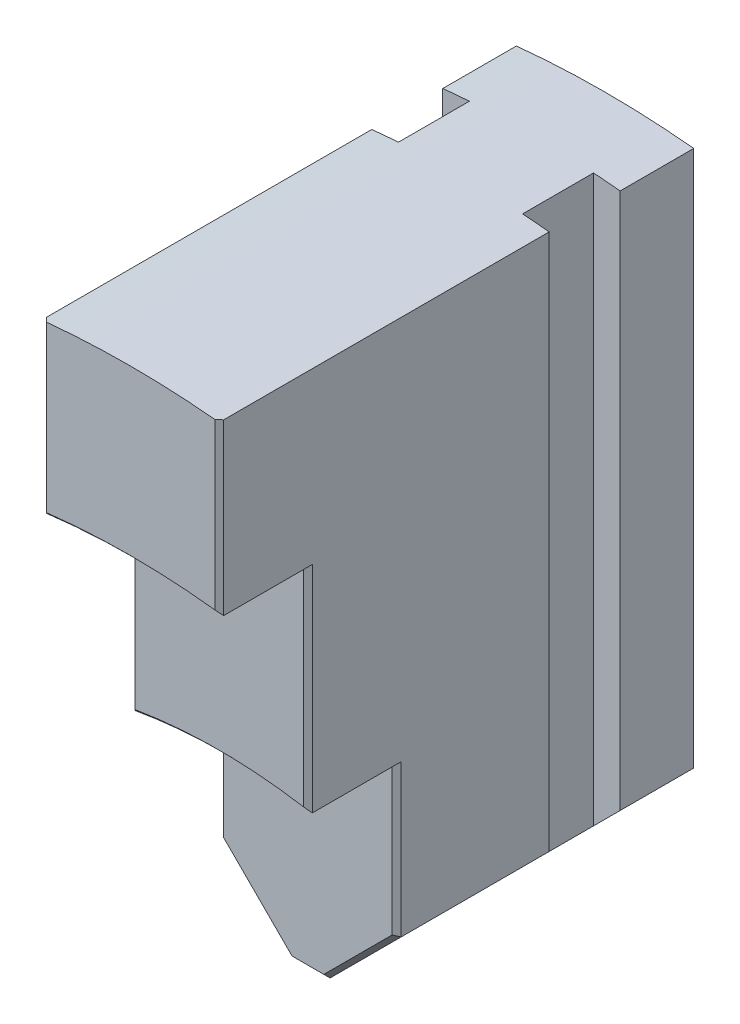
from build123d import *

# Parameters (mm, degrees)
BASE_EXTRUSION_DEPTH      = 32.5
BASE_EXTRUSION_DEPTH_BACK = 21
ESQUISSE2_W               = 10
ESQUISSE2_H               = 8
ENL_V_MAT_EXTRU_3_DEPTH   = 77.923663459
ESQUISSE9_R               = 81
ENL_V_MAT_EXTRU_9_DEPTH   = 10
ESQUISSE10_R              = 57
ENL_V_MAT_EXTRU_11_DEPTH  = 10
CHANFREIN3_SIZE           = 0.5


with BuildPart() as part:
    # Esquisse1 → Base-Extrusion (new, two sides: drawn at the far end of the back side and taken through both)
    with BuildSketch(Plane.XY.offset(-BASE_EXTRUSION_DEPTH_BACK)):
        with BuildLine():
            Line((2, 0), (10, 8))
            Line((10, 8), (10, 68.498743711))
            ThreePointArc((10, 68.498743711), (0, 69), (-10, 68.498743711))
            Line((-10, 68.498743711), (-10, 8))
            Line((-10, 8), (-2, 0))
            Line((-2, 0), (2, 0))
        make_face()
    extrude(amount=BASE_EXTRUSION_DEPTH + BASE_EXTRUSION_DEPTH_BACK)

    # Esquisse2 → Enl_v. mat.-Extru.3 (cut, through all)
    with BuildSketch(Plane(origin=(0, 0, 0), x_dir=(1, 0, 0), z_dir=(0, 1, 0))):
        with Locations((-12, 8.7)):
            Rectangle(ESQUISSE2_W, ESQUISSE2_H)
        with Locations((12, 8.7)):
            Rectangle(ESQUISSE2_W, ESQUISSE2_H)
    extrude(amount=ENL_V_MAT_EXTRU_3_DEPTH, mode=Mode.SUBTRACT)

    # Esquisse9 → Enl_v. mat.-Extru.9 (cut)
    with BuildSketch(Plane.XY.offset(32.5)):
        with Locations((0, -31)):
            Circle(ESQUISSE9_R)
    extrude(amount=-ENL_V_MAT_EXTRU_9_DEPTH, mode=Mode.SUBTRACT)

    # Esquisse10 → Enl_v. mat.-Extru.11 (cut)
    with BuildSketch(Plane.XY.offset(22.5)):
        with Locations((0, -31)):
            Circle(ESQUISSE10_R)
    extrude(amount=-ENL_V_MAT_EXTRU_11_DEPTH, mode=Mode.SUBTRACT)

    # Chanfrein3
    chanfrein3_edges = [part.edges().sort_by_distance(p)[0] for p in [
        (6, 4, 12.5),
        (0, 0, 12.5),
        (10, 58.939544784, 32.5),
        (10, 37.248148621, 22.5),
        (10, 16.557975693, 12.5),
        (-6, 4, 12.5),
        (-10, 16.557975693, 12.5),
        (0, 50, 32.5),
        (-10, 58.939544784, 32.5),
        (0, 26, 22.5),
        (-10, 37.248148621, 22.5),
    ]]
    chamfer(chanfrein3_edges, length=CHANFREIN3_SIZE)


solid = part.part
